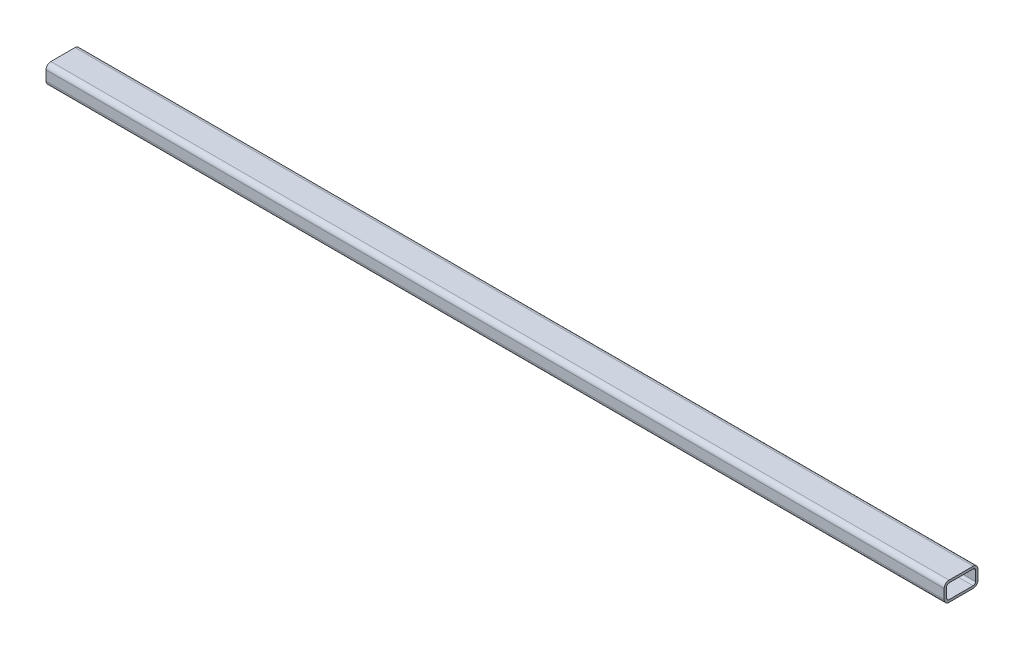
from build123d import *

# Parameters (mm, degrees)
BASE_EXTRUSION_DEPTH = 930


with BuildPart() as part:
    # Esquisse1 → Base-Extrusion (new body)
    with BuildSketch(Plane(origin=(0, 0, 0), x_dir=(0, 0, -1), z_dir=(1, 0, 0))):
        with BuildLine():
            Line((-12.5, 10), (12.5, 10))
            ThreePointArc((12.5, 10), (16.035533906, 8.535533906), (17.5, 5))
            Line((17.5, 5), (17.5, -5))
            ThreePointArc((17.5, -5), (16.035533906, -8.535533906), (12.5, -10))
            Line((12.5, -10), (-12.5, -10))
            ThreePointArc((-12.5, -10), (-16.035533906, -8.535533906), (-17.5, -5))
            Line((-17.5, -5), (-17.5, 5))
            ThreePointArc((-17.5, 5), (-16.035533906, 8.535533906), (-12.5, 10))
        make_face()
        with BuildLine():
            Line((-12.5, 7.5), (12.5, 7.5))
            ThreePointArc((12.5, 7.5), (14.267766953, 6.767766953), (15, 5))
            Line((15, 5), (15, -5))
            ThreePointArc((15, -5), (14.267766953, -6.767766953), (12.5, -7.5))
            Line((12.5, -7.5), (-12.5, -7.5))
            ThreePointArc((-12.5, -7.5), (-14.267766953, -6.767766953), (-15, -5))
            Line((-15, -5), (-15, 5))
            ThreePointArc((-15, 5), (-14.267766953, 6.767766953), (-12.5, 7.5))
        make_face(mode=Mode.SUBTRACT)
    extrude(amount=BASE_EXTRUSION_DEPTH)


solid = part.part
